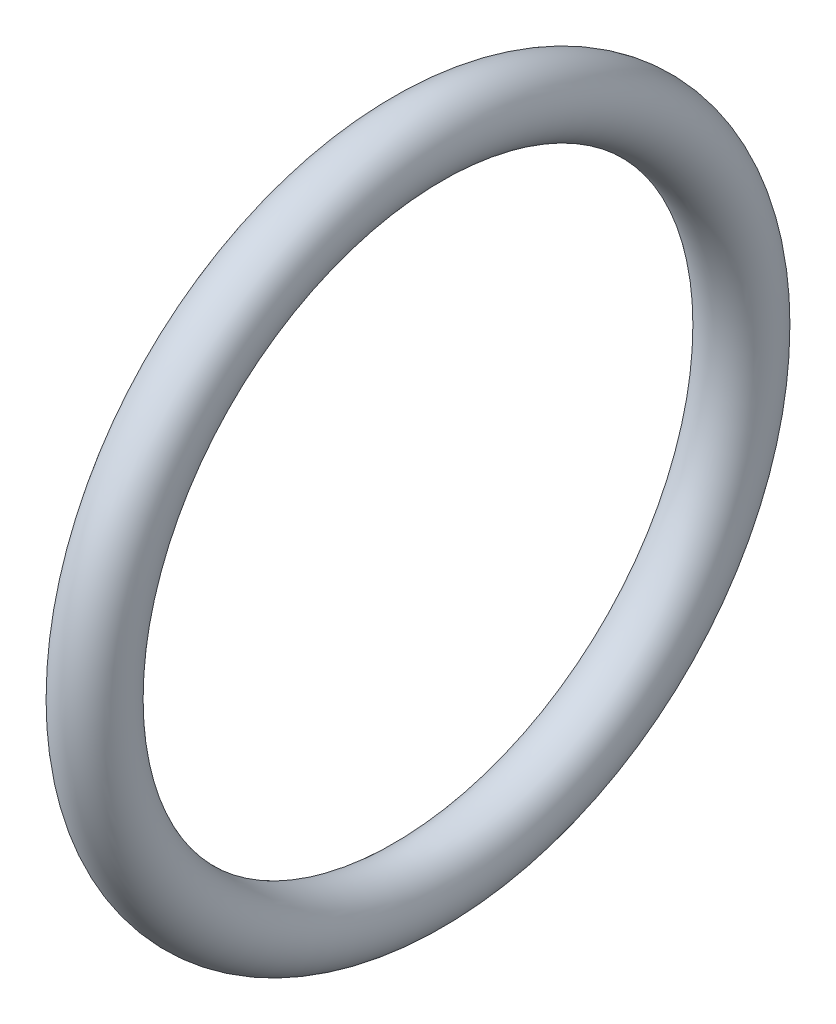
from build123d import *

# Parameters (mm, degrees)
ESQUISSE1_R = 0.95


with BuildPart() as part:
    # Esquisse1 → R_volution1 (revolve)
    with BuildSketch(Plane(origin=(0, 0, 0), x_dir=(1, 0, 0), z_dir=(0, 1, 0)), mode=Mode.PRIVATE) as r_volution1_sk:
        with Locations((-0.628156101, 8.95)):
            Circle(ESQUISSE1_R)
    revolve(r_volution1_sk.sketch.rotate(Axis((-46.232289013, 0, 0), (1, 0, 0)), 180), axis=Axis((-46.232289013, 0, 0), (1, 0, 0)))


solid = part.part
